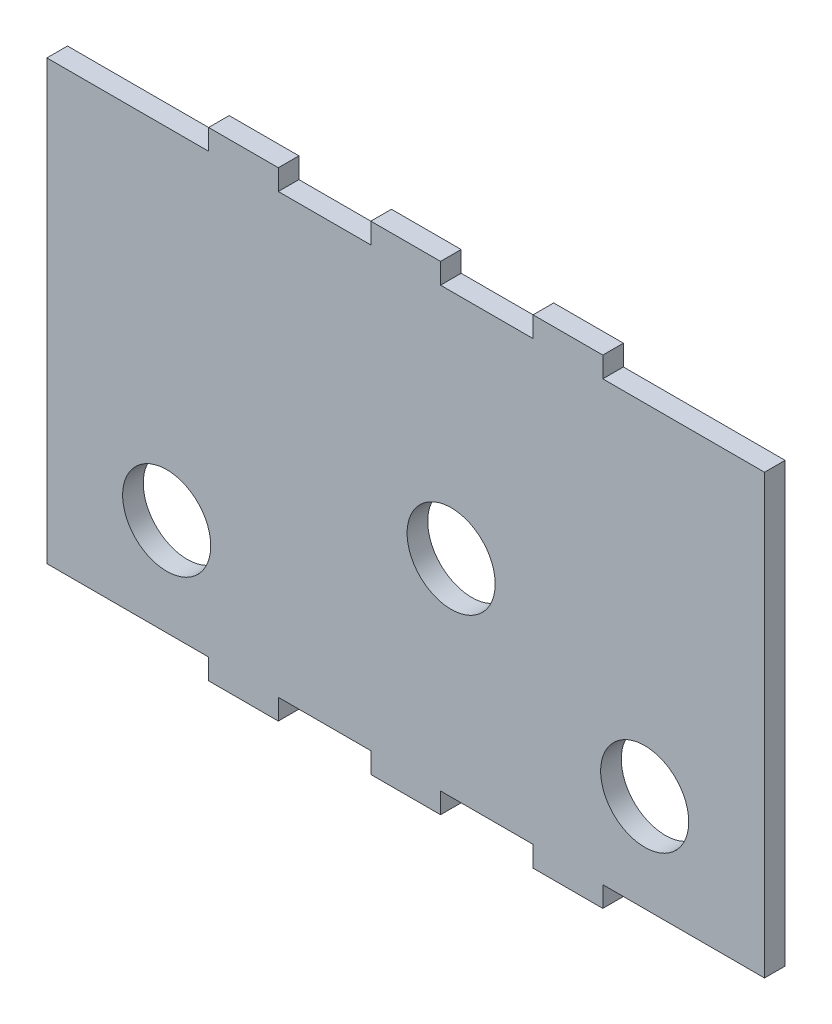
from build123d import *

# Parameters (mm, degrees)
SKETCH1_R           = 13.575
BOSS_EXTRUDE1_DEPTH = 6.35


with BuildPart() as part:
    # Sketch1 → Boss-Extrude1 (new body)
    with BuildSketch(Plane.XY):
        Polygon((99.84, 0), (99.84, -6.35), (121.325, -6.35), (121.325, 0), (149.84, 0), (149.84, -6.35), (171.325, -6.35), (171.325, 0), (221.165, 0), (221.165, 135), (171.325, 135), (171.325, 141.35), (149.84, 141.35), (149.84, 135), (121.325, 135), (121.325, 141.35), (99.84, 141.35), (99.84, 135), (71.325, 135), (71.325, 141.35), (49.84, 141.35), (49.84, 135), (0, 135), (0, 0), (49.84, 0), (49.84, -6.35), (71.325, -6.35), (71.325, 0), align=None)
        with Locations((36.9225, 30)):
            Circle(SKETCH1_R, mode=Mode.SUBTRACT)
        with Locations((184.2425, 30)):
            Circle(SKETCH1_R, mode=Mode.SUBTRACT)
        with Locations((124.588874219, 63.670386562)):
            Circle(SKETCH1_R, mode=Mode.SUBTRACT)
    extrude(amount=BOSS_EXTRUDE1_DEPTH)


solid = part.part
